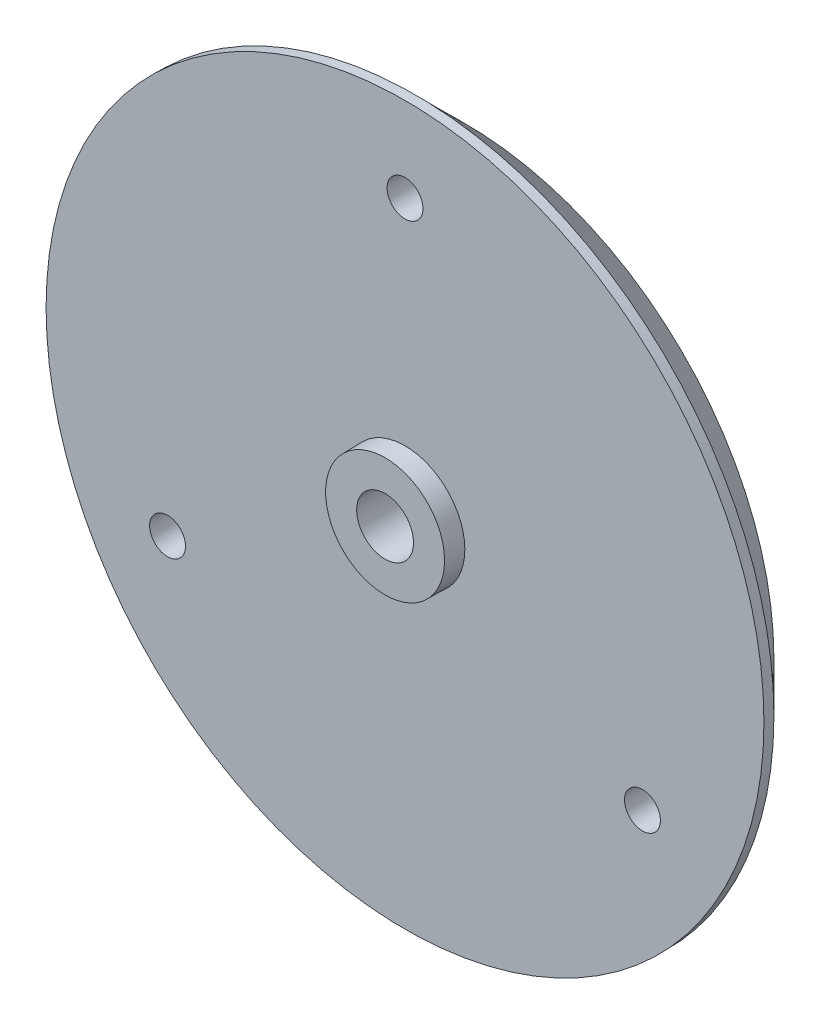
ISO-10303-21;
HEADER;
FILE_DESCRIPTION(('STEP AP214'),'2;1');
FILE_NAME('part.step','',(''),(''),'','','');
FILE_SCHEMA(('AUTOMOTIVE_DESIGN { 1 0 10303 214 1 1 1 1 }'));
ENDSEC;
DATA;
#1=APPLICATION_CONTEXT('core data for automotive mechanical design processes');
#2=APPLICATION_PROTOCOL_DEFINITION('international standard','automotive_design',2000,#1);
#3=PRODUCT_CONTEXT('',#1,'mechanical');
#4=PRODUCT('Part','Part','',(#3));
#5=PRODUCT_RELATED_PRODUCT_CATEGORY('part','',(#4));
#6=PRODUCT_DEFINITION_FORMATION('','',#4);
#7=PRODUCT_DEFINITION_CONTEXT('part definition',#1,'design');
#8=PRODUCT_DEFINITION('design','',#6,#7);
#9=PRODUCT_DEFINITION_SHAPE('','',#8);
#10=(LENGTH_UNIT() NAMED_UNIT(*) SI_UNIT(.MILLI.,.METRE.));
#11=(NAMED_UNIT(*) PLANE_ANGLE_UNIT() SI_UNIT($,.RADIAN.));
#12=(NAMED_UNIT(*) SI_UNIT($,.STERADIAN.) SOLID_ANGLE_UNIT());
#13=UNCERTAINTY_MEASURE_WITH_UNIT(LENGTH_MEASURE(1.E-05),#10,'distance_accuracy_value','');
#14=(GEOMETRIC_REPRESENTATION_CONTEXT(3) GLOBAL_UNCERTAINTY_ASSIGNED_CONTEXT((#13)) GLOBAL_UNIT_ASSIGNED_CONTEXT((#10,
#11,#12)) REPRESENTATION_CONTEXT('',''));
#15=CARTESIAN_POINT('',(0.,0.,0.));
#16=DIRECTION('',(0.,0.,1.));
#17=DIRECTION('',(1.,0.,0.));
#18=AXIS2_PLACEMENT_3D('',#15,#16,#17);
#19=CARTESIAN_POINT('',(-29.85,-29.85,0.));
#20=DIRECTION('',(0.,0.,1.));
#21=DIRECTION('',(1.,0.,0.));
#22=AXIS2_PLACEMENT_3D('',#19,#20,#21);
#23=PLANE('',#22);
#24=CARTESIAN_POINT('',(-29.85,-29.85,0.));
#25=DIRECTION('',(0.,0.,1.));
#26=DIRECTION('',(1.,0.,0.));
#27=AXIS2_PLACEMENT_3D('',#24,#25,#26);
#28=CIRCLE('',#27,17.99955);
#29=CARTESIAN_POINT('',(-11.85045,-29.85,0.));
#30=VERTEX_POINT('',#29);
#31=EDGE_CURVE('E37',#30,#30,#28,.T.);
#32=ORIENTED_EDGE('',*,*,#31,.T.);
#33=EDGE_LOOP('',(#32));
#34=FACE_BOUND('',#33,.T.);
#35=CARTESIAN_POINT('',(-29.85,-16.10034375,0.));
#36=DIRECTION('',(0.,0.,-1.));
#37=DIRECTION('',(-1.,0.,0.));
#38=AXIS2_PLACEMENT_3D('',#35,#36,#37);
#39=CIRCLE('',#38,0.8999775);
#40=CARTESIAN_POINT('',(-30.7499775,-16.10034375,0.));
#41=VERTEX_POINT('',#40);
#42=EDGE_CURVE('E134',#41,#41,#39,.T.);
#43=ORIENTED_EDGE('',*,*,#42,.T.);
#44=EDGE_LOOP('',(#43));
#45=FACE_BOUND('',#44,.T.);
#46=CARTESIAN_POINT('',(-17.9424483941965,-36.7248281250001,0.));
#47=DIRECTION('',(0.,0.,-1.));
#48=DIRECTION('',(0.5,0.866025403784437,0.));
#49=AXIS2_PLACEMENT_3D('',#46,#47,#48);
#50=CIRCLE('',#49,0.8999775);
#51=CARTESIAN_POINT('',(-17.4924596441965,-35.9454247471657,0.));
#52=VERTEX_POINT('',#51);
#53=EDGE_CURVE('E126',#52,#52,#50,.T.);
#54=ORIENTED_EDGE('',*,*,#53,.T.);
#55=EDGE_LOOP('',(#54));
#56=FACE_BOUND('',#55,.T.);
#57=CARTESIAN_POINT('',(-41.7575516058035,-36.7248281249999,0.));
#58=DIRECTION('',(0.,0.,-1.));
#59=DIRECTION('',(0.499999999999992,-0.866025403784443,0.));
#60=AXIS2_PLACEMENT_3D('',#57,#58,#59);
#61=CIRCLE('',#60,0.8999775);
#62=CARTESIAN_POINT('',(-41.3075628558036,-37.5042315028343,0.));
#63=VERTEX_POINT('',#62);
#64=EDGE_CURVE('E97',#63,#63,#61,.T.);
#65=ORIENTED_EDGE('',*,*,#64,.T.);
#66=EDGE_LOOP('',(#65));
#67=FACE_BOUND('',#66,.T.);
#68=CARTESIAN_POINT('',(-29.85,-29.85,0.));
#69=DIRECTION('',(0.,0.,1.));
#70=DIRECTION('',(1.,0.,0.));
#71=AXIS2_PLACEMENT_3D('',#68,#69,#70);
#72=CIRCLE('',#71,2.999925);
#73=CARTESIAN_POINT('',(-26.850075,-29.85,0.));
#74=VERTEX_POINT('',#73);
#75=EDGE_CURVE('E84',#74,#74,#72,.T.);
#76=ORIENTED_EDGE('',*,*,#75,.F.);
#77=EDGE_LOOP('',(#76));
#78=FACE_BOUND('',#77,.T.);
#79=ADVANCED_FACE('F14',(#34,#45,#56,#67,#78),#23,.T.);
#80=CARTESIAN_POINT('',(-29.85,-29.85,-2.999925));
#81=DIRECTION('',(0.,0.,1.));
#82=DIRECTION('',(1.,0.,0.));
#83=AXIS2_PLACEMENT_3D('',#80,#81,#82);
#84=PLANE('',#83);
#85=CARTESIAN_POINT('',(-29.85,-29.85,-2.999925));
#86=DIRECTION('',(0.,0.,1.));
#87=DIRECTION('',(1.,0.,0.));
#88=AXIS2_PLACEMENT_3D('',#85,#86,#87);
#89=CIRCLE('',#88,8.97770365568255);
#90=CARTESIAN_POINT('',(-20.8722963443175,-29.85,-2.999925));
#91=VERTEX_POINT('',#90);
#92=EDGE_CURVE('E53',#91,#91,#89,.F.);
#93=ORIENTED_EDGE('',*,*,#92,.F.);
#94=EDGE_LOOP('',(#93));
#95=FACE_BOUND('',#94,.T.);
#96=CARTESIAN_POINT('',(-29.85,-29.85,-2.999925));
#97=DIRECTION('',(0.,0.,1.));
#98=DIRECTION('',(1.,0.,0.));
#99=AXIS2_PLACEMENT_3D('',#96,#97,#98);
#100=CIRCLE('',#99,10.9217988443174);
#101=CARTESIAN_POINT('',(-18.9282011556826,-29.85,-2.999925));
#102=VERTEX_POINT('',#101);
#103=EDGE_CURVE('E70',#102,#102,#100,.F.);
#104=ORIENTED_EDGE('',*,*,#103,.T.);
#105=EDGE_LOOP('',(#104));
#106=FACE_BOUND('',#105,.T.);
#107=ADVANCED_FACE('F203',(#95,#106),#84,.F.);
#108=CARTESIAN_POINT('',(-29.85,-29.85,-2.999925));
#109=DIRECTION('',(0.,0.,1.));
#110=DIRECTION('',(1.,0.,0.));
#111=AXIS2_PLACEMENT_3D('',#108,#109,#110);
#112=CIRCLE('',#111,6.97775365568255);
#113=CARTESIAN_POINT('',(-22.8722463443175,-29.85,-2.999925));
#114=VERTEX_POINT('',#113);
#115=EDGE_CURVE('E59',#114,#114,#112,.F.);
#116=ORIENTED_EDGE('',*,*,#115,.F.);
#117=EDGE_LOOP('',(#116));
#118=FACE_BOUND('',#117,.T.);
#119=CARTESIAN_POINT('',(-29.85,-29.85,-2.999925));
#120=DIRECTION('',(0.,0.,1.));
#121=DIRECTION('',(1.,0.,0.));
#122=AXIS2_PLACEMENT_3D('',#119,#120,#121);
#123=CIRCLE('',#122,7.92187384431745);
#124=CARTESIAN_POINT('',(-21.9281261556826,-29.85,-2.999925));
#125=VERTEX_POINT('',#124);
#126=EDGE_CURVE('E74',#125,#125,#123,.F.);
#127=ORIENTED_EDGE('',*,*,#126,.T.);
#128=EDGE_LOOP('',(#127));
#129=FACE_BOUND('',#128,.T.);
#130=ADVANCED_FACE('F209',(#118,#129),#84,.F.);
#131=CARTESIAN_POINT('',(-29.85,-29.85,-2.999925));
#132=DIRECTION('',(0.,0.,1.));
#133=DIRECTION('',(1.,0.,0.));
#134=AXIS2_PLACEMENT_3D('',#131,#132,#133);
#135=CIRCLE('',#134,4.97780365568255);
#136=CARTESIAN_POINT('',(-24.8721963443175,-29.85,-2.999925));
#137=VERTEX_POINT('',#136);
#138=EDGE_CURVE('E65',#137,#137,#135,.F.);
#139=ORIENTED_EDGE('',*,*,#138,.F.);
#140=EDGE_LOOP('',(#139));
#141=FACE_BOUND('',#140,.T.);
#142=CARTESIAN_POINT('',(-29.85,-29.85,-2.999925));
#143=DIRECTION('',(0.,0.,1.));
#144=DIRECTION('',(1.,0.,0.));
#145=AXIS2_PLACEMENT_3D('',#142,#143,#144);
#146=CIRCLE('',#145,5.92192384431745);
#147=CARTESIAN_POINT('',(-23.9280761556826,-29.85,-2.999925));
#148=VERTEX_POINT('',#147);
#149=EDGE_CURVE('E46',#148,#148,#146,.F.);
#150=ORIENTED_EDGE('',*,*,#149,.T.);
#151=EDGE_LOOP('',(#150));
#152=FACE_BOUND('',#151,.T.);
#153=ADVANCED_FACE('F234',(#141,#152),#84,.F.);
#154=CARTESIAN_POINT('',(-29.85,-29.85,-1.399965));
#155=DIRECTION('',(0.,0.,-1.));
#156=DIRECTION('',(-1.,0.,0.));
#157=AXIS2_PLACEMENT_3D('',#154,#155,#156);
#158=CONICAL_SURFACE('',#157,4.94987625,0.0174532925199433);
#159=CARTESIAN_POINT('',(-29.85,-29.85,-1.399965));
#160=DIRECTION('',(0.,0.,-1.));
#161=DIRECTION('',(-1.,0.,0.));
#162=AXIS2_PLACEMENT_3D('',#159,#160,#161);
#163=CIRCLE('',#162,4.94987625);
#164=CARTESIAN_POINT('',(-34.79987625,-29.85,-1.399965));
#165=VERTEX_POINT('',#164);
#166=EDGE_CURVE('E69',#165,#165,#163,.T.);
#167=ORIENTED_EDGE('',*,*,#166,.F.);
#168=EDGE_LOOP('',(#167));
#169=FACE_BOUND('',#168,.T.);
#170=ORIENTED_EDGE('',*,*,#138,.T.);
#171=EDGE_LOOP('',(#170));
#172=FACE_BOUND('',#171,.T.);
#173=ADVANCED_FACE('F231',(#169,#172),#158,.F.);
#174=CARTESIAN_POINT('',(-29.85,-29.85,-1.399965));
#175=DIRECTION('',(0.,0.,-1.));
#176=DIRECTION('',(-1.,0.,0.));
#177=AXIS2_PLACEMENT_3D('',#174,#175,#176);
#178=PLANE('',#177);
#179=CARTESIAN_POINT('',(-29.85,-29.85,-1.399965));
#180=DIRECTION('',(0.,0.,-1.));
#181=DIRECTION('',(-1.,0.,0.));
#182=AXIS2_PLACEMENT_3D('',#179,#180,#181);
#183=CIRCLE('',#182,3.94990125);
#184=CARTESIAN_POINT('',(-33.79990125,-29.85,-1.399965));
#185=VERTEX_POINT('',#184);
#186=EDGE_CURVE('E45',#185,#185,#183,.T.);
#187=ORIENTED_EDGE('',*,*,#186,.F.);
#188=EDGE_LOOP('',(#187));
#189=FACE_BOUND('',#188,.T.);
#190=ORIENTED_EDGE('',*,*,#166,.T.);
#191=EDGE_LOOP('',(#190));
#192=FACE_BOUND('',#191,.T.);
#193=ADVANCED_FACE('F217',(#189,#192),#178,.T.);
#194=CARTESIAN_POINT('',(-29.85,-29.85,-1.399965));
#195=DIRECTION('',(0.,0.,1.));
#196=DIRECTION('',(-1.,0.,0.));
#197=AXIS2_PLACEMENT_3D('',#194,#195,#196);
#198=CONICAL_SURFACE('',#197,3.94990125,0.0174532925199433);
#199=ORIENTED_EDGE('',*,*,#186,.T.);
#200=EDGE_LOOP('',(#199));
#201=FACE_BOUND('',#200,.T.);
#202=CARTESIAN_POINT('',(-29.85,-29.85,-2.999925));
#203=DIRECTION('',(0.,0.,1.));
#204=DIRECTION('',(1.,0.,0.));
#205=AXIS2_PLACEMENT_3D('',#202,#203,#204);
#206=CIRCLE('',#205,3.92197384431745);
#207=CARTESIAN_POINT('',(-25.9280261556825,-29.85,-2.999925));
#208=VERTEX_POINT('',#207);
#209=EDGE_CURVE('E41',#208,#208,#206,.F.);
#210=ORIENTED_EDGE('',*,*,#209,.F.);
#211=EDGE_LOOP('',(#210));
#212=FACE_BOUND('',#211,.T.);
#213=ADVANCED_FACE('F213',(#201,#212),#198,.T.);
#214=CARTESIAN_POINT('',(-29.85,-29.85,-2.999925));
#215=DIRECTION('',(0.,0.,-1.));
#216=DIRECTION('',(-1.,0.,0.));
#217=AXIS2_PLACEMENT_3D('',#214,#215,#216);
#218=CIRCLE('',#217,1.424964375);
#219=CARTESIAN_POINT('',(-31.274964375,-29.85,-2.999925));
#220=VERTEX_POINT('',#219);
#221=EDGE_CURVE('E115',#220,#220,#218,.T.);
#222=ORIENTED_EDGE('',*,*,#221,.F.);
#223=EDGE_LOOP('',(#222));
#224=FACE_BOUND('',#223,.T.);
#225=ORIENTED_EDGE('',*,*,#209,.T.);
#226=EDGE_LOOP('',(#225));
#227=FACE_BOUND('',#226,.T.);
#228=ADVANCED_FACE('F216',(#224,#227),#84,.F.);
#229=CARTESIAN_POINT('',(-29.85,-29.85,-1.399965));
#230=DIRECTION('',(0.,0.,-1.));
#231=DIRECTION('',(-1.,0.,0.));
#232=AXIS2_PLACEMENT_3D('',#229,#230,#231);
#233=CONICAL_SURFACE('',#232,6.94982625,0.0174532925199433);
#234=CARTESIAN_POINT('',(-29.85,-29.85,-1.399965));
#235=DIRECTION('',(0.,0.,-1.));
#236=DIRECTION('',(-1.,0.,0.));
#237=AXIS2_PLACEMENT_3D('',#234,#235,#236);
#238=CIRCLE('',#237,6.94982625);
#239=CARTESIAN_POINT('',(-36.79982625,-29.85,-1.399965));
#240=VERTEX_POINT('',#239);
#241=EDGE_CURVE('E64',#240,#240,#238,.T.);
#242=ORIENTED_EDGE('',*,*,#241,.F.);
#243=EDGE_LOOP('',(#242));
#244=FACE_BOUND('',#243,.T.);
#245=ORIENTED_EDGE('',*,*,#115,.T.);
#246=EDGE_LOOP('',(#245));
#247=FACE_BOUND('',#246,.T.);
#248=ADVANCED_FACE('F236',(#244,#247),#233,.F.);
#249=CARTESIAN_POINT('',(-29.85,-29.85,-1.399965));
#250=DIRECTION('',(0.,0.,-1.));
#251=DIRECTION('',(-1.,0.,0.));
#252=AXIS2_PLACEMENT_3D('',#249,#250,#251);
#253=PLANE('',#252);
#254=CARTESIAN_POINT('',(-29.85,-29.85,-1.399965));
#255=DIRECTION('',(0.,0.,-1.));
#256=DIRECTION('',(-1.,0.,0.));
#257=AXIS2_PLACEMENT_3D('',#254,#255,#256);
#258=CIRCLE('',#257,5.94985125);
#259=CARTESIAN_POINT('',(-35.79985125,-29.85,-1.399965));
#260=VERTEX_POINT('',#259);
#261=EDGE_CURVE('E63',#260,#260,#258,.T.);
#262=ORIENTED_EDGE('',*,*,#261,.F.);
#263=EDGE_LOOP('',(#262));
#264=FACE_BOUND('',#263,.T.);
#265=ORIENTED_EDGE('',*,*,#241,.T.);
#266=EDGE_LOOP('',(#265));
#267=FACE_BOUND('',#266,.T.);
#268=ADVANCED_FACE('F223',(#264,#267),#253,.T.);
#269=CARTESIAN_POINT('',(-29.85,-29.85,-1.399965));
#270=DIRECTION('',(0.,0.,1.));
#271=DIRECTION('',(-1.,0.,0.));
#272=AXIS2_PLACEMENT_3D('',#269,#270,#271);
#273=CONICAL_SURFACE('',#272,5.94985125,0.0174532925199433);
#274=ORIENTED_EDGE('',*,*,#261,.T.);
#275=EDGE_LOOP('',(#274));
#276=FACE_BOUND('',#275,.T.);
#277=ORIENTED_EDGE('',*,*,#149,.F.);
#278=EDGE_LOOP('',(#277));
#279=FACE_BOUND('',#278,.T.);
#280=ADVANCED_FACE('F219',(#276,#279),#273,.T.);
#281=CARTESIAN_POINT('',(-29.85,-29.85,-1.399965));
#282=DIRECTION('',(0.,0.,-1.));
#283=DIRECTION('',(-1.,0.,0.));
#284=AXIS2_PLACEMENT_3D('',#281,#282,#283);
#285=CONICAL_SURFACE('',#284,8.94977625,0.0174532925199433);
#286=CARTESIAN_POINT('',(-29.85,-29.85,-1.399965));
#287=DIRECTION('',(0.,0.,-1.));
#288=DIRECTION('',(-1.,0.,0.));
#289=AXIS2_PLACEMENT_3D('',#286,#287,#288);
#290=CIRCLE('',#289,8.94977625);
#291=CARTESIAN_POINT('',(-38.79977625,-29.85,-1.399965));
#292=VERTEX_POINT('',#291);
#293=EDGE_CURVE('E58',#292,#292,#290,.T.);
#294=ORIENTED_EDGE('',*,*,#293,.F.);
#295=EDGE_LOOP('',(#294));
#296=FACE_BOUND('',#295,.T.);
#297=ORIENTED_EDGE('',*,*,#92,.T.);
#298=EDGE_LOOP('',(#297));
#299=FACE_BOUND('',#298,.T.);
#300=ADVANCED_FACE('F222',(#296,#299),#285,.F.);
#301=CARTESIAN_POINT('',(-29.85,-29.85,-1.399965));
#302=DIRECTION('',(0.,0.,-1.));
#303=DIRECTION('',(-1.,0.,0.));
#304=AXIS2_PLACEMENT_3D('',#301,#302,#303);
#305=PLANE('',#304);
#306=CARTESIAN_POINT('',(-29.85,-29.85,-1.399965));
#307=DIRECTION('',(0.,0.,-1.));
#308=DIRECTION('',(-1.,0.,0.));
#309=AXIS2_PLACEMENT_3D('',#306,#307,#308);
#310=CIRCLE('',#309,7.94980125);
#311=CARTESIAN_POINT('',(-37.79980125,-29.85,-1.399965));
#312=VERTEX_POINT('',#311);
#313=EDGE_CURVE('E57',#312,#312,#310,.T.);
#314=ORIENTED_EDGE('',*,*,#313,.F.);
#315=EDGE_LOOP('',(#314));
#316=FACE_BOUND('',#315,.T.);
#317=ORIENTED_EDGE('',*,*,#293,.T.);
#318=EDGE_LOOP('',(#317));
#319=FACE_BOUND('',#318,.T.);
#320=ADVANCED_FACE('F228',(#316,#319),#305,.T.);
#321=CARTESIAN_POINT('',(-29.85,-29.85,-1.399965));
#322=DIRECTION('',(0.,0.,1.));
#323=DIRECTION('',(-1.,0.,0.));
#324=AXIS2_PLACEMENT_3D('',#321,#322,#323);
#325=CONICAL_SURFACE('',#324,7.94980125,0.0174532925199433);
#326=ORIENTED_EDGE('',*,*,#313,.T.);
#327=EDGE_LOOP('',(#326));
#328=FACE_BOUND('',#327,.T.);
#329=ORIENTED_EDGE('',*,*,#126,.F.);
#330=EDGE_LOOP('',(#329));
#331=FACE_BOUND('',#330,.T.);
#332=ADVANCED_FACE('F225',(#328,#331),#325,.T.);
#333=CARTESIAN_POINT('',(-29.85,-29.85,-1.399965));
#334=DIRECTION('',(0.,0.,-1.));
#335=DIRECTION('',(-1.,0.,0.));
#336=AXIS2_PLACEMENT_3D('',#333,#334,#335);
#337=CONICAL_SURFACE('',#336,11.94970125,0.0174532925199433);
#338=CARTESIAN_POINT('',(-29.85,-29.85,-1.399965));
#339=DIRECTION('',(0.,0.,-1.));
#340=DIRECTION('',(-1.,0.,0.));
#341=AXIS2_PLACEMENT_3D('',#338,#339,#340);
#342=CIRCLE('',#341,11.94970125);
#343=CARTESIAN_POINT('',(-41.79970125,-29.85,-1.399965));
#344=VERTEX_POINT('',#343);
#345=EDGE_CURVE('E52',#344,#344,#342,.T.);
#346=ORIENTED_EDGE('',*,*,#345,.F.);
#347=EDGE_LOOP('',(#346));
#348=FACE_BOUND('',#347,.T.);
#349=CARTESIAN_POINT('',(-29.85,-29.85,-2.999925));
#350=DIRECTION('',(0.,0.,1.));
#351=DIRECTION('',(1.,0.,0.));
#352=AXIS2_PLACEMENT_3D('',#349,#350,#351);
#353=CIRCLE('',#352,11.9776286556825);
#354=CARTESIAN_POINT('',(-17.8723713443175,-29.85,-2.999925));
#355=VERTEX_POINT('',#354);
#356=EDGE_CURVE('E47',#355,#355,#353,.F.);
#357=ORIENTED_EDGE('',*,*,#356,.T.);
#358=EDGE_LOOP('',(#357));
#359=FACE_BOUND('',#358,.T.);
#360=ADVANCED_FACE('F227',(#348,#359),#337,.F.);
#361=CARTESIAN_POINT('',(-29.85,-29.85,-1.399965));
#362=DIRECTION('',(0.,0.,-1.));
#363=DIRECTION('',(-1.,0.,0.));
#364=AXIS2_PLACEMENT_3D('',#361,#362,#363);
#365=PLANE('',#364);
#366=CARTESIAN_POINT('',(-29.85,-29.85,-1.399965));
#367=DIRECTION('',(0.,0.,-1.));
#368=DIRECTION('',(-1.,0.,0.));
#369=AXIS2_PLACEMENT_3D('',#366,#367,#368);
#370=CIRCLE('',#369,10.94972625);
#371=CARTESIAN_POINT('',(-40.79972625,-29.85,-1.399965));
#372=VERTEX_POINT('',#371);
#373=EDGE_CURVE('E51',#372,#372,#370,.T.);
#374=ORIENTED_EDGE('',*,*,#373,.F.);
#375=EDGE_LOOP('',(#374));
#376=FACE_BOUND('',#375,.T.);
#377=ORIENTED_EDGE('',*,*,#345,.T.);
#378=EDGE_LOOP('',(#377));
#379=FACE_BOUND('',#378,.T.);
#380=ADVANCED_FACE('F199',(#376,#379),#365,.T.);
#381=CARTESIAN_POINT('',(-29.85,-29.85,-1.399965));
#382=DIRECTION('',(0.,0.,1.));
#383=DIRECTION('',(-1.,0.,0.));
#384=AXIS2_PLACEMENT_3D('',#381,#382,#383);
#385=CONICAL_SURFACE('',#384,10.94972625,0.0174532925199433);
#386=ORIENTED_EDGE('',*,*,#373,.T.);
#387=EDGE_LOOP('',(#386));
#388=FACE_BOUND('',#387,.T.);
#389=ORIENTED_EDGE('',*,*,#103,.F.);
#390=EDGE_LOOP('',(#389));
#391=FACE_BOUND('',#390,.T.);
#392=ADVANCED_FACE('F188',(#388,#391),#385,.T.);
#393=CARTESIAN_POINT('',(-29.85,-29.85,0.));
#394=DIRECTION('',(0.,0.,1.));
#395=DIRECTION('',(-1.,0.,0.));
#396=AXIS2_PLACEMENT_3D('',#393,#394,#395);
#397=CONICAL_SURFACE('',#396,17.99955,0.0174532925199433);
#398=CARTESIAN_POINT('',(-29.85,-29.85,-0.508869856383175));
#399=DIRECTION('',(0.,0.,-1.));
#400=DIRECTION('',(-1.,0.,0.));
#401=AXIS2_PLACEMENT_3D('',#398,#399,#400);
#402=CIRCLE('',#401,17.9906676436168);
#403=CARTESIAN_POINT('',(-47.8406676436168,-29.85,-0.508869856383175));
#404=VERTEX_POINT('',#403);
#405=EDGE_CURVE('E18',#404,#404,#402,.F.);
#406=ORIENTED_EDGE('',*,*,#405,.T.);
#407=EDGE_LOOP('',(#406));
#408=FACE_BOUND('',#407,.T.);
#409=ORIENTED_EDGE('',*,*,#31,.F.);
#410=EDGE_LOOP('',(#409));
#411=FACE_BOUND('',#410,.T.);
#412=ADVANCED_FACE('F16',(#408,#411),#397,.T.);
#413=CARTESIAN_POINT('',(-29.85,-29.85,-0.499987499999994));
#414=DIRECTION('',(0.,0.,1.));
#415=DIRECTION('',(1.,0.,0.));
#416=AXIS2_PLACEMENT_3D('',#413,#414,#415);
#417=CONICAL_SURFACE('',#416,17.99955,0.78539816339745);
#418=CARTESIAN_POINT('',(-29.85,-29.85,-2.999925));
#419=DIRECTION('',(0.,0.,1.));
#420=DIRECTION('',(1.,0.,0.));
#421=AXIS2_PLACEMENT_3D('',#418,#419,#420);
#422=CIRCLE('',#421,15.4996125);
#423=CARTESIAN_POINT('',(-14.3503875,-29.85,-2.999925));
#424=VERTEX_POINT('',#423);
#425=EDGE_CURVE('E10',#424,#424,#422,.F.);
#426=ORIENTED_EDGE('',*,*,#425,.F.);
#427=EDGE_LOOP('',(#426));
#428=FACE_BOUND('',#427,.T.);
#429=ORIENTED_EDGE('',*,*,#405,.F.);
#430=EDGE_LOOP('',(#429));
#431=FACE_BOUND('',#430,.T.);
#432=ADVANCED_FACE('F187',(#428,#431),#417,.T.);
#433=CARTESIAN_POINT('',(-41.7575516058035,-36.7248281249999,-2.999925));
#434=DIRECTION('',(0.,0.,-1.));
#435=DIRECTION('',(0.499999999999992,-0.866025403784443,0.));
#436=AXIS2_PLACEMENT_3D('',#433,#434,#435);
#437=CIRCLE('',#436,0.8999775);
#438=CARTESIAN_POINT('',(-41.3075628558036,-37.5042315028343,-2.999925));
#439=VERTEX_POINT('',#438);
#440=EDGE_CURVE('E83',#439,#439,#437,.T.);
#441=ORIENTED_EDGE('',*,*,#440,.F.);
#442=EDGE_LOOP('',(#441));
#443=FACE_BOUND('',#442,.T.);
#444=CARTESIAN_POINT('',(-17.9424483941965,-36.7248281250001,-2.999925));
#445=DIRECTION('',(0.,0.,-1.));
#446=DIRECTION('',(0.5,0.866025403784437,0.));
#447=AXIS2_PLACEMENT_3D('',#444,#445,#446);
#448=CIRCLE('',#447,0.8999775);
#449=CARTESIAN_POINT('',(-17.4924596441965,-35.9454247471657,-2.999925));
#450=VERTEX_POINT('',#449);
#451=EDGE_CURVE('E122',#450,#450,#448,.T.);
#452=ORIENTED_EDGE('',*,*,#451,.F.);
#453=EDGE_LOOP('',(#452));
#454=FACE_BOUND('',#453,.T.);
#455=CARTESIAN_POINT('',(-29.85,-16.10034375,-2.999925));
#456=DIRECTION('',(0.,0.,-1.));
#457=DIRECTION('',(-1.,0.,0.));
#458=AXIS2_PLACEMENT_3D('',#455,#456,#457);
#459=CIRCLE('',#458,0.8999775);
#460=CARTESIAN_POINT('',(-30.7499775,-16.10034375,-2.999925));
#461=VERTEX_POINT('',#460);
#462=EDGE_CURVE('E130',#461,#461,#459,.T.);
#463=ORIENTED_EDGE('',*,*,#462,.F.);
#464=EDGE_LOOP('',(#463));
#465=FACE_BOUND('',#464,.T.);
#466=ORIENTED_EDGE('',*,*,#356,.F.);
#467=EDGE_LOOP('',(#466));
#468=FACE_BOUND('',#467,.T.);
#469=ORIENTED_EDGE('',*,*,#425,.T.);
#470=EDGE_LOOP('',(#469));
#471=FACE_BOUND('',#470,.T.);
#472=ADVANCED_FACE('F196',(#443,#454,#465,#468,#471),#84,.F.);
#473=CARTESIAN_POINT('',(-29.85,-16.10034375,0.));
#474=DIRECTION('',(0.,0.,-1.));
#475=DIRECTION('',(-1.,0.,0.));
#476=AXIS2_PLACEMENT_3D('',#473,#474,#475);
#477=CYLINDRICAL_SURFACE('',#476,0.8999775);
#478=ORIENTED_EDGE('',*,*,#42,.F.);
#479=EDGE_LOOP('',(#478));
#480=FACE_BOUND('',#479,.T.);
#481=ORIENTED_EDGE('',*,*,#462,.T.);
#482=EDGE_LOOP('',(#481));
#483=FACE_BOUND('',#482,.T.);
#484=ADVANCED_FACE('F265',(#480,#483),#477,.F.);
#485=CARTESIAN_POINT('',(-17.9424483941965,-36.7248281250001,0.));
#486=DIRECTION('',(0.,0.,-1.));
#487=DIRECTION('',(-1.,0.,0.));
#488=AXIS2_PLACEMENT_3D('',#485,#486,#487);
#489=CYLINDRICAL_SURFACE('',#488,0.8999775);
#490=ORIENTED_EDGE('',*,*,#53,.F.);
#491=EDGE_LOOP('',(#490));
#492=FACE_BOUND('',#491,.T.);
#493=ORIENTED_EDGE('',*,*,#451,.T.);
#494=EDGE_LOOP('',(#493));
#495=FACE_BOUND('',#494,.T.);
#496=ADVANCED_FACE('F258',(#492,#495),#489,.F.);
#497=CARTESIAN_POINT('',(-41.7575516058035,-36.7248281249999,0.));
#498=DIRECTION('',(0.,0.,-1.));
#499=DIRECTION('',(-1.,0.,0.));
#500=AXIS2_PLACEMENT_3D('',#497,#498,#499);
#501=CYLINDRICAL_SURFACE('',#500,0.8999775);
#502=ORIENTED_EDGE('',*,*,#64,.F.);
#503=EDGE_LOOP('',(#502));
#504=FACE_BOUND('',#503,.T.);
#505=ORIENTED_EDGE('',*,*,#440,.T.);
#506=EDGE_LOOP('',(#505));
#507=FACE_BOUND('',#506,.T.);
#508=ADVANCED_FACE('F248',(#504,#507),#501,.F.);
#509=CARTESIAN_POINT('',(-29.85,-29.85,0.));
#510=DIRECTION('',(0.,0.,-1.));
#511=DIRECTION('',(1.,0.,0.));
#512=AXIS2_PLACEMENT_3D('',#509,#510,#511);
#513=CONICAL_SURFACE('',#512,2.999925,0.0174532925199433);
#514=CARTESIAN_POINT('',(-29.85,-29.85,0.999975));
#515=DIRECTION('',(0.,0.,1.));
#516=DIRECTION('',(1.,0.,0.));
#517=AXIS2_PLACEMENT_3D('',#514,#515,#516);
#518=CIRCLE('',#517,2.98247037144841);
#519=CARTESIAN_POINT('',(-26.8675296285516,-29.85,0.999975));
#520=VERTEX_POINT('',#519);
#521=EDGE_CURVE('E80',#520,#520,#518,.T.);
#522=ORIENTED_EDGE('',*,*,#521,.F.);
#523=EDGE_LOOP('',(#522));
#524=FACE_BOUND('',#523,.T.);
#525=ORIENTED_EDGE('',*,*,#75,.T.);
#526=EDGE_LOOP('',(#525));
#527=FACE_BOUND('',#526,.T.);
#528=ADVANCED_FACE('F245',(#524,#527),#513,.T.);
#529=CARTESIAN_POINT('',(-29.85,-29.85,0.999975));
#530=DIRECTION('',(0.,0.,1.));
#531=DIRECTION('',(1.,0.,0.));
#532=AXIS2_PLACEMENT_3D('',#529,#530,#531);
#533=PLANE('',#532);
#534=CARTESIAN_POINT('',(-29.85,-29.85,0.999975));
#535=DIRECTION('',(0.,0.,-1.));
#536=DIRECTION('',(-1.,0.,0.));
#537=AXIS2_PLACEMENT_3D('',#534,#535,#536);
#538=CIRCLE('',#537,1.424964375);
#539=CARTESIAN_POINT('',(-31.274964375,-29.85,0.999975));
#540=VERTEX_POINT('',#539);
#541=EDGE_CURVE('E101',#540,#540,#538,.T.);
#542=ORIENTED_EDGE('',*,*,#541,.T.);
#543=EDGE_LOOP('',(#542));
#544=FACE_BOUND('',#543,.T.);
#545=ORIENTED_EDGE('',*,*,#521,.T.);
#546=EDGE_LOOP('',(#545));
#547=FACE_BOUND('',#546,.T.);
#548=ADVANCED_FACE('F247',(#544,#547),#533,.T.);
#549=CARTESIAN_POINT('',(-29.85,-29.85,0.999975));
#550=DIRECTION('',(0.,0.,-1.));
#551=DIRECTION('',(-1.,0.,0.));
#552=AXIS2_PLACEMENT_3D('',#549,#550,#551);
#553=CYLINDRICAL_SURFACE('',#552,1.424964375);
#554=ORIENTED_EDGE('',*,*,#541,.F.);
#555=EDGE_LOOP('',(#554));
#556=FACE_BOUND('',#555,.T.);
#557=ORIENTED_EDGE('',*,*,#221,.T.);
#558=EDGE_LOOP('',(#557));
#559=FACE_BOUND('',#558,.T.);
#560=ADVANCED_FACE('F255',(#556,#559),#553,.F.);
#561=CLOSED_SHELL('',(#79,#107,#130,#153,#173,#193,#213,#228,#248,#268,#280,#300,#320,#332,#360,
#380,#392,#412,#432,#472,#484,#496,#508,#528,#548,#560));
#562=MANIFOLD_SOLID_BREP('B1',#561);
#563=ADVANCED_BREP_SHAPE_REPRESENTATION('',(#18,#562),#14);
#564=SHAPE_DEFINITION_REPRESENTATION(#9,#563);
ENDSEC;
END-ISO-10303-21;
